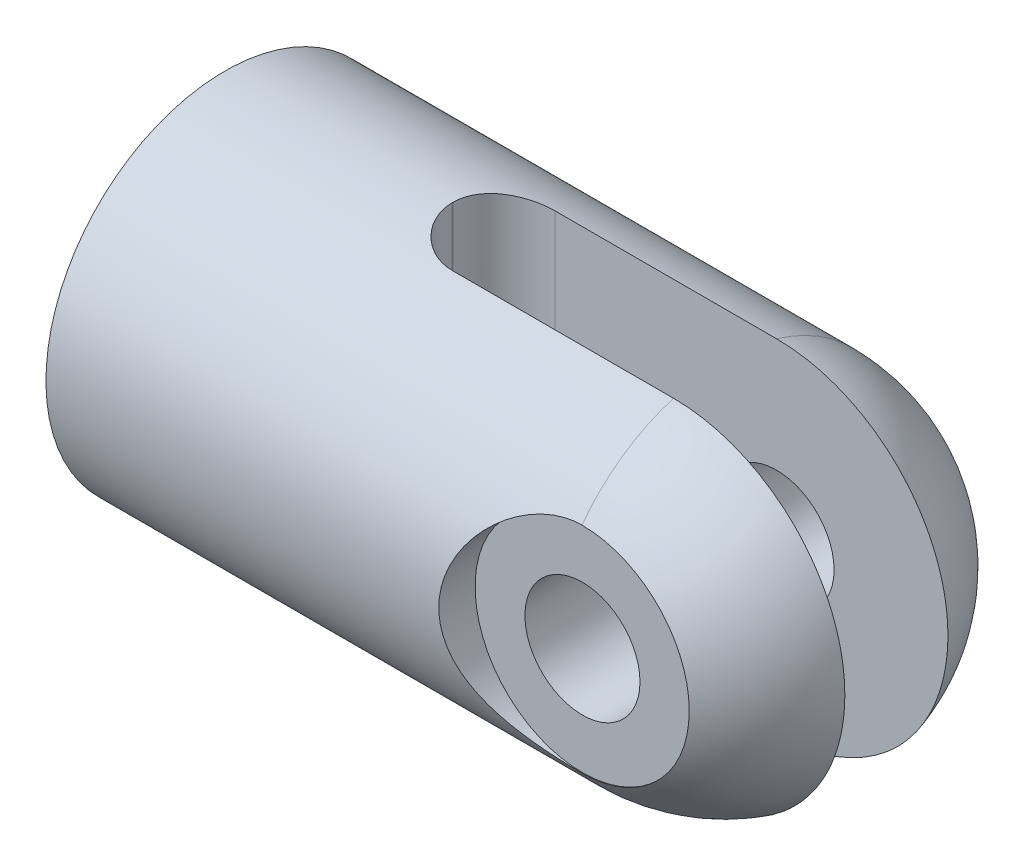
from build123d import *

# Parameters (mm, degrees)
CUT_EXTRUDE1_DEPTH                    = 127
TAPPED_HOLE_FOR_10_32_HELICOIL1_D     = 5.1054
TAPPED_HOLE_FOR_10_32_HELICOIL1_DEPTH = 6.985
TAPPED_HOLE_FOR_10_32_HELICOIL1_TIP   = 1.533816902
SKETCH10_R                            = 4.7625
CUT_EXTRUDE2_DEPTH                    = 1.8034
F_10_CLEARANCE_HOLE1_D                = 5.1054
F_10_CLEARANCE_HOLE1_DEPTH            = 6.35
F_10_CLEARANCE_HOLE1_TIP              = 1.533816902
TAPPED_HOLE_FOR_10_32_HELICOIL2_D     = 5.1054
TAPPED_HOLE_FOR_10_32_HELICOIL2_DEPTH = 11.9888
TAPPED_HOLE_FOR_10_32_HELICOIL2_TIP   = 1.533816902


with BuildPart() as part:
    # Sketch1 → Revolve1 (revolve)
    with BuildSketch(Plane.XY, mode=Mode.PRIVATE) as revolve1_sk:
        with BuildLine():
            Line((-15.0622, 0), (15.0622, 0))
            ThreePointArc((15.0622, 0), (12.737360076, 5.612660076), (7.1247, 7.9375))
            Line((7.1247, 7.9375), (-15.0622, 7.9375))
            Line((-15.0622, 7.9375), (-15.0622, 0))
        make_face()
    revolve(revolve1_sk.sketch.rotate(Axis((-15.0622, 0, 0), (1, 0, 0)), 180), axis=Axis((-15.0622, 0, 0), (1, 0, 0)))

    # Sketch2 → Cut-Extrude1 (cut, symmetric)
    with BuildSketch(Plane(origin=(0, 0, 0), x_dir=(1, 0, 0), z_dir=(0, 1, 0))):
        with BuildLine():
            Line((14.72589137, 2.286), (-2.69850863, 2.286))
            ThreePointArc((-2.69850863, 2.286), (-4.296994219, 1.62388559), (-4.95910863, 0.0254))
            Line((-4.95910863, 0.0254), (-4.95910863, -0.0254))
            ThreePointArc((-4.95910863, -0.0254), (-4.296994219, -1.62388559), (-2.69850863, -2.286))
            Line((-2.69850863, -2.286), (14.72589137, -2.286))
            ThreePointArc((14.72589137, -2.286), (15.0622, 0), (14.72589137, 2.286))
        make_face()
    extrude(amount=CUT_EXTRUDE1_DEPTH, both=True, mode=Mode.SUBTRACT)

    # Tapped Hole for _10-32 Helicoil1
    with Locations(Plane(origin=(-15.0622, 0, 0), x_dir=(0, -1, 0), z_dir=(-1, 0, 0))):
        with Locations((0, 0)):
            Hole(TAPPED_HOLE_FOR_10_32_HELICOIL1_D / 2, depth=TAPPED_HOLE_FOR_10_32_HELICOIL1_DEPTH)
            with Locations((0, 0, -(TAPPED_HOLE_FOR_10_32_HELICOIL1_DEPTH + TAPPED_HOLE_FOR_10_32_HELICOIL1_TIP / 2))):  # 118° drill point
                Cone(0, TAPPED_HOLE_FOR_10_32_HELICOIL1_D / 2, TAPPED_HOLE_FOR_10_32_HELICOIL1_TIP, mode=Mode.SUBTRACT)

    # Sketch10 → Cut-Extrude2 (cut)
    with BuildSketch(Plane.XY.offset(8.128)):
        with Locations((7.1247, 0)):
            Circle(SKETCH10_R)
    extrude(amount=-CUT_EXTRUDE2_DEPTH, mode=Mode.SUBTRACT)

    # 10 Clearance Hole1
    with Locations(Plane(origin=(7.1247, 0, 6.3246), x_dir=(1, 0, 0), z_dir=(0, 0, 1))):
        with Locations((0, 0)):
            Hole(F_10_CLEARANCE_HOLE1_D / 2, depth=F_10_CLEARANCE_HOLE1_DEPTH)
            with Locations((0, 0, -(F_10_CLEARANCE_HOLE1_DEPTH + F_10_CLEARANCE_HOLE1_TIP / 2))):  # 118° drill point
                Cone(0, F_10_CLEARANCE_HOLE1_D / 2, F_10_CLEARANCE_HOLE1_TIP, mode=Mode.SUBTRACT)

    # Tapped Hole for _10-32 Helicoil2
    with Locations(Plane(origin=(7.1247, 0, -2.286), x_dir=(1, 0, 0), z_dir=(0, 0, 1))):
        with Locations((0, 0)):
            Hole(TAPPED_HOLE_FOR_10_32_HELICOIL2_D / 2, depth=TAPPED_HOLE_FOR_10_32_HELICOIL2_DEPTH)
            with Locations((0, 0, -(TAPPED_HOLE_FOR_10_32_HELICOIL2_DEPTH + TAPPED_HOLE_FOR_10_32_HELICOIL2_TIP / 2))):  # 118° drill point
                Cone(0, TAPPED_HOLE_FOR_10_32_HELICOIL2_D / 2, TAPPED_HOLE_FOR_10_32_HELICOIL2_TIP, mode=Mode.SUBTRACT)


solid = part.part
